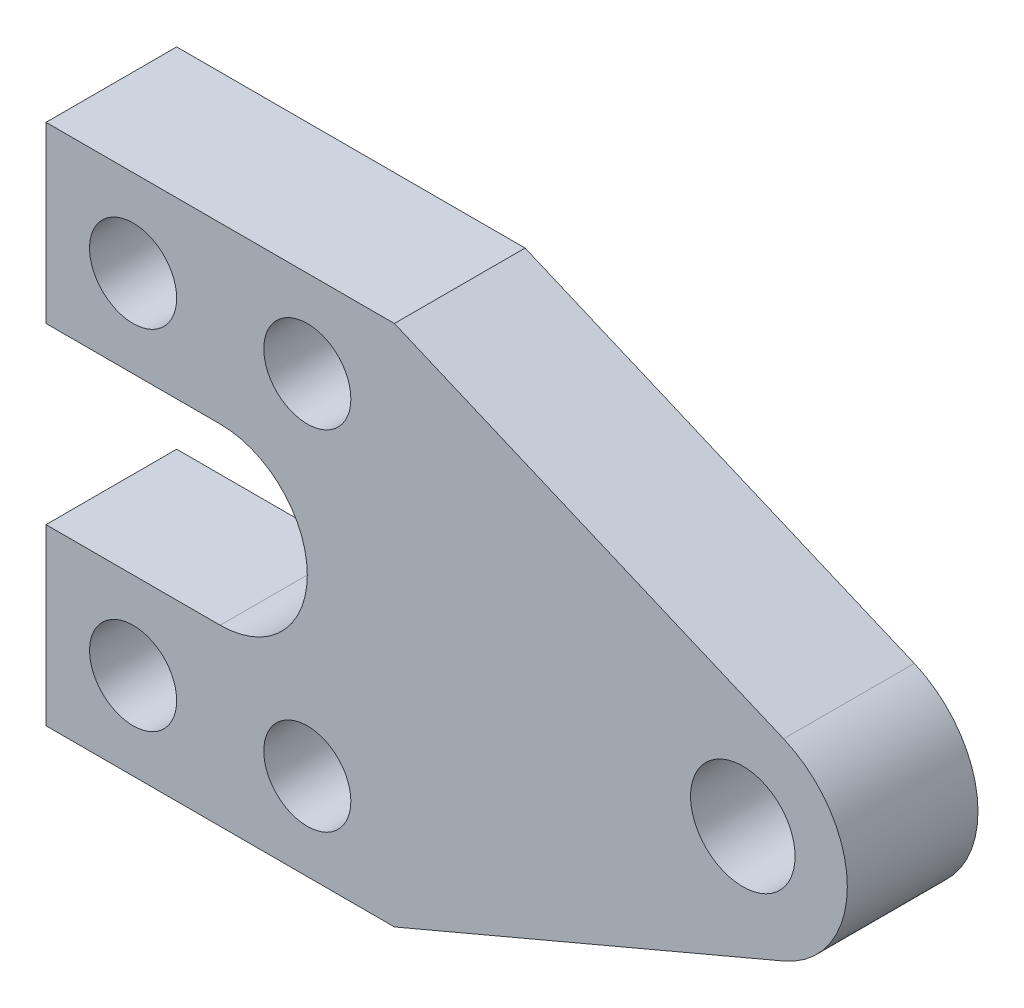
from build123d import *

# Parameters (mm, degrees)
SKETCH1_R            = 6
BOSS_EXTRUDE1_DEPTH  = 15
SKETCH2_R            = 5
CUT_EXTRUDE1_DEPTH   = 15
LPATTERN1_COUNT      = 2
LPATTERN1_PITCH      = 40
LPATTERN1_COUNT_DIR2 = 2
LPATTERN1_PITCH_DIR2 = 20


with BuildPart() as part:
    # Sketch1 → Boss-Extrude1 (new body)
    with BuildSketch(Plane.XY):
        with BuildLine():
            Line((10, 50), (30, 50))
            ThreePointArc((30, 50), (40, 40), (30, 30))
            Line((30, 30), (10, 30))
            Line((10, 30), (10, 10))
            Line((10, 10), (50, 10))
            Line((50, 10), (94.685564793, 28.952580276))
            ThreePointArc((94.685564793, 28.952580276), (102, 40), (94.685564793, 51.047419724))
            Line((94.685564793, 51.047419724), (50, 70))
            Line((50, 70), (10, 70))
            Line((10, 70), (10, 50))
        make_face()
        with Locations((90, 40)):
            Circle(SKETCH1_R, mode=Mode.SUBTRACT)
    extrude(amount=BOSS_EXTRUDE1_DEPTH)

    # Sketch2 → Cut-Extrude1 (cut)
    with BuildSketch(Plane.XY.offset(15)):
        with Locations((20, 20)):
            Circle(SKETCH2_R)
    cut_extrude1 = extrude(amount=-CUT_EXTRUDE1_DEPTH, mode=Mode.SUBTRACT)

    # LPattern1: Cut-Extrude1 2 × 2
    with Locations(*[(j * LPATTERN1_PITCH_DIR2, i * LPATTERN1_PITCH, 0) for i in range(LPATTERN1_COUNT) for j in range(LPATTERN1_COUNT_DIR2) if (i, j) != (0, 0)]):
        add(cut_extrude1, mode=Mode.SUBTRACT)


solid = part.part
